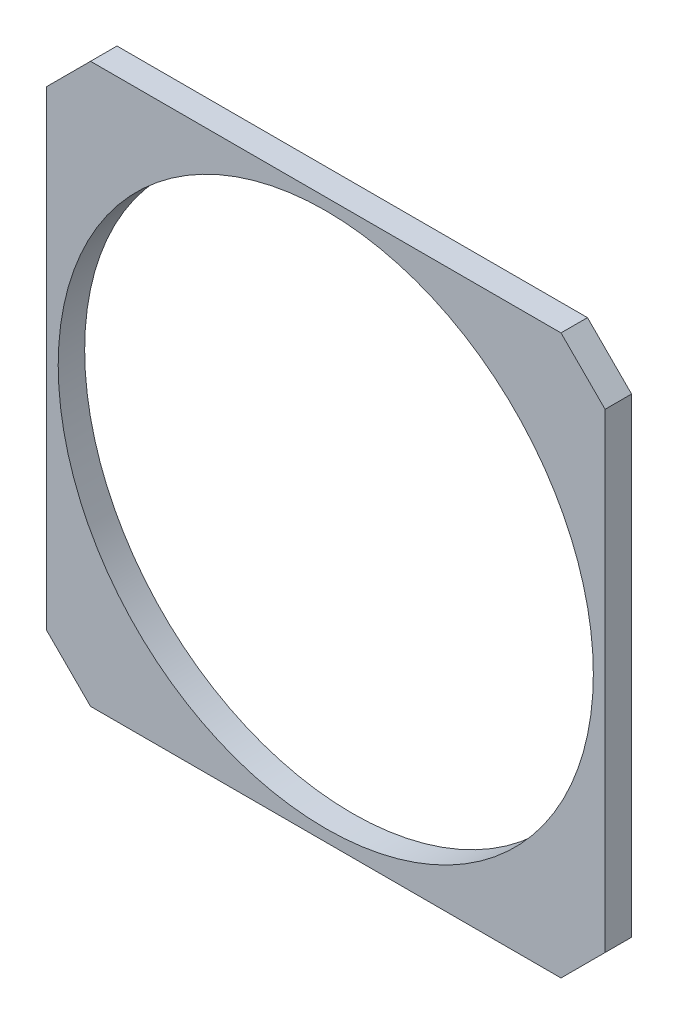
ISO-10303-21;
HEADER;
FILE_DESCRIPTION(('STEP AP214'),'2;1');
FILE_NAME('part.step','',(''),(''),'','','');
FILE_SCHEMA(('AUTOMOTIVE_DESIGN { 1 0 10303 214 1 1 1 1 }'));
ENDSEC;
DATA;
#1=APPLICATION_CONTEXT('core data for automotive mechanical design processes');
#2=APPLICATION_PROTOCOL_DEFINITION('international standard','automotive_design',2000,#1);
#3=PRODUCT_CONTEXT('',#1,'mechanical');
#4=PRODUCT('Part','Part','',(#3));
#5=PRODUCT_RELATED_PRODUCT_CATEGORY('part','',(#4));
#6=PRODUCT_DEFINITION_FORMATION('','',#4);
#7=PRODUCT_DEFINITION_CONTEXT('part definition',#1,'design');
#8=PRODUCT_DEFINITION('design','',#6,#7);
#9=PRODUCT_DEFINITION_SHAPE('','',#8);
#10=(LENGTH_UNIT() NAMED_UNIT(*) SI_UNIT(.MILLI.,.METRE.));
#11=(NAMED_UNIT(*) PLANE_ANGLE_UNIT() SI_UNIT($,.RADIAN.));
#12=(NAMED_UNIT(*) SI_UNIT($,.STERADIAN.) SOLID_ANGLE_UNIT());
#13=UNCERTAINTY_MEASURE_WITH_UNIT(LENGTH_MEASURE(1.E-05),#10,'distance_accuracy_value','');
#14=(GEOMETRIC_REPRESENTATION_CONTEXT(3) GLOBAL_UNCERTAINTY_ASSIGNED_CONTEXT((#13)) GLOBAL_UNIT_ASSIGNED_CONTEXT((#10,
#11,#12)) REPRESENTATION_CONTEXT('',''));
#15=CARTESIAN_POINT('',(0.,0.,0.));
#16=DIRECTION('',(0.,0.,1.));
#17=DIRECTION('',(1.,0.,0.));
#18=AXIS2_PLACEMENT_3D('',#15,#16,#17);
#19=CARTESIAN_POINT('',(0.,0.,4.5));
#20=DIRECTION('',(0.,0.,-1.));
#21=DIRECTION('',(-1.,0.,0.));
#22=AXIS2_PLACEMENT_3D('',#19,#20,#21);
#23=PLANE('',#22);
#24=DIRECTION('',(-0.707106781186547,-0.707106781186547,0.));
#25=VECTOR('',#24,1.);
#26=CARTESIAN_POINT('',(-47.5,40.,4.5));
#27=LINE('',#26,#25);
#28=CARTESIAN_POINT('',(-40.,47.5,4.5));
#29=VERTEX_POINT('',#28);
#30=CARTESIAN_POINT('',(-47.5,40.,4.5));
#31=VERTEX_POINT('',#30);
#32=EDGE_CURVE('E147',#29,#31,#27,.T.);
#33=ORIENTED_EDGE('',*,*,#32,.T.);
#34=DIRECTION('',(0.,-1.,0.));
#35=VECTOR('',#34,1.);
#36=CARTESIAN_POINT('',(-47.5,-40.,4.5));
#37=LINE('',#36,#35);
#38=CARTESIAN_POINT('',(-47.5,-40.,4.5));
#39=VERTEX_POINT('',#38);
#40=EDGE_CURVE('E95',#31,#39,#37,.T.);
#41=ORIENTED_EDGE('',*,*,#40,.T.);
#42=DIRECTION('',(0.707106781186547,-0.707106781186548,0.));
#43=VECTOR('',#42,1.);
#44=CARTESIAN_POINT('',(-40.,-47.5,4.5));
#45=LINE('',#44,#43);
#46=CARTESIAN_POINT('',(-40.,-47.5,4.5));
#47=VERTEX_POINT('',#46);
#48=EDGE_CURVE('E162',#39,#47,#45,.T.);
#49=ORIENTED_EDGE('',*,*,#48,.T.);
#50=DIRECTION('',(1.,0.,0.));
#51=VECTOR('',#50,1.);
#52=CARTESIAN_POINT('',(40.,-47.5,4.5));
#53=LINE('',#52,#51);
#54=CARTESIAN_POINT('',(40.,-47.5,4.5));
#55=VERTEX_POINT('',#54);
#56=EDGE_CURVE('E175',#47,#55,#53,.T.);
#57=ORIENTED_EDGE('',*,*,#56,.T.);
#58=DIRECTION('',(0.707106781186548,0.707106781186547,0.));
#59=VECTOR('',#58,1.);
#60=CARTESIAN_POINT('',(47.5,-40.,4.5));
#61=LINE('',#60,#59);
#62=CARTESIAN_POINT('',(47.5,-40.,4.5));
#63=VERTEX_POINT('',#62);
#64=EDGE_CURVE('E114',#55,#63,#61,.T.);
#65=ORIENTED_EDGE('',*,*,#64,.T.);
#66=DIRECTION('',(0.,1.,0.));
#67=VECTOR('',#66,1.);
#68=CARTESIAN_POINT('',(47.5,40.,4.5));
#69=LINE('',#68,#67);
#70=CARTESIAN_POINT('',(47.5,40.,4.5));
#71=VERTEX_POINT('',#70);
#72=EDGE_CURVE('E108',#63,#71,#69,.T.);
#73=ORIENTED_EDGE('',*,*,#72,.T.);
#74=DIRECTION('',(-0.707106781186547,0.707106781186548,0.));
#75=VECTOR('',#74,1.);
#76=CARTESIAN_POINT('',(40.,47.5,4.5));
#77=LINE('',#76,#75);
#78=CARTESIAN_POINT('',(40.,47.5,4.5));
#79=VERTEX_POINT('',#78);
#80=EDGE_CURVE('E112',#71,#79,#77,.T.);
#81=ORIENTED_EDGE('',*,*,#80,.T.);
#82=DIRECTION('',(-1.,0.,0.));
#83=VECTOR('',#82,1.);
#84=CARTESIAN_POINT('',(-40.,47.5,4.5));
#85=LINE('',#84,#83);
#86=EDGE_CURVE('E52',#79,#29,#85,.T.);
#87=ORIENTED_EDGE('',*,*,#86,.T.);
#88=EDGE_LOOP('',(#33,#41,#49,#57,#65,#73,#81,#87));
#89=FACE_BOUND('',#88,.T.);
#90=CARTESIAN_POINT('',(0.,0.,4.5));
#91=DIRECTION('',(0.,0.,1.));
#92=DIRECTION('',(1.,0.,0.));
#93=AXIS2_PLACEMENT_3D('',#90,#91,#92);
#94=CIRCLE('',#93,45.5);
#95=CARTESIAN_POINT('',(45.5,0.,4.5));
#96=VERTEX_POINT('',#95);
#97=EDGE_CURVE('E136',#96,#96,#94,.T.);
#98=ORIENTED_EDGE('',*,*,#97,.F.);
#99=EDGE_LOOP('',(#98));
#100=FACE_BOUND('',#99,.T.);
#101=ADVANCED_FACE('F35',(#89,#100),#23,.F.);
#102=CARTESIAN_POINT('',(0.,0.,0.));
#103=DIRECTION('',(0.,0.,-1.));
#104=DIRECTION('',(-1.,0.,0.));
#105=AXIS2_PLACEMENT_3D('',#102,#103,#104);
#106=PLANE('',#105);
#107=DIRECTION('',(-0.707106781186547,-0.707106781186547,0.));
#108=VECTOR('',#107,1.);
#109=CARTESIAN_POINT('',(-47.5,40.,0.));
#110=LINE('',#109,#108);
#111=CARTESIAN_POINT('',(-40.,47.5,0.));
#112=VERTEX_POINT('',#111);
#113=CARTESIAN_POINT('',(-47.5,40.,0.));
#114=VERTEX_POINT('',#113);
#115=EDGE_CURVE('E132',#112,#114,#110,.T.);
#116=ORIENTED_EDGE('',*,*,#115,.F.);
#117=DIRECTION('',(-1.,0.,0.));
#118=VECTOR('',#117,1.);
#119=CARTESIAN_POINT('',(-40.,47.5,0.));
#120=LINE('',#119,#118);
#121=CARTESIAN_POINT('',(40.,47.5,0.));
#122=VERTEX_POINT('',#121);
#123=EDGE_CURVE('E87',#122,#112,#120,.T.);
#124=ORIENTED_EDGE('',*,*,#123,.F.);
#125=DIRECTION('',(-0.707106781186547,0.707106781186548,0.));
#126=VECTOR('',#125,1.);
#127=CARTESIAN_POINT('',(40.,47.5,0.));
#128=LINE('',#127,#126);
#129=CARTESIAN_POINT('',(47.5,40.,0.));
#130=VERTEX_POINT('',#129);
#131=EDGE_CURVE('E81',#130,#122,#128,.T.);
#132=ORIENTED_EDGE('',*,*,#131,.F.);
#133=DIRECTION('',(0.,1.,0.));
#134=VECTOR('',#133,1.);
#135=CARTESIAN_POINT('',(47.5,40.,0.));
#136=LINE('',#135,#134);
#137=CARTESIAN_POINT('',(47.5,-40.,0.));
#138=VERTEX_POINT('',#137);
#139=EDGE_CURVE('E122',#138,#130,#136,.T.);
#140=ORIENTED_EDGE('',*,*,#139,.F.);
#141=DIRECTION('',(0.707106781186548,0.707106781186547,0.));
#142=VECTOR('',#141,1.);
#143=CARTESIAN_POINT('',(47.5,-40.,0.));
#144=LINE('',#143,#142);
#145=CARTESIAN_POINT('',(40.,-47.5,0.));
#146=VERTEX_POINT('',#145);
#147=EDGE_CURVE('E142',#146,#138,#144,.T.);
#148=ORIENTED_EDGE('',*,*,#147,.F.);
#149=DIRECTION('',(1.,0.,0.));
#150=VECTOR('',#149,1.);
#151=CARTESIAN_POINT('',(40.,-47.5,0.));
#152=LINE('',#151,#150);
#153=CARTESIAN_POINT('',(-40.,-47.5,0.));
#154=VERTEX_POINT('',#153);
#155=EDGE_CURVE('E140',#154,#146,#152,.T.);
#156=ORIENTED_EDGE('',*,*,#155,.F.);
#157=DIRECTION('',(0.707106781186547,-0.707106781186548,0.));
#158=VECTOR('',#157,1.);
#159=CARTESIAN_POINT('',(-40.,-47.5,0.));
#160=LINE('',#159,#158);
#161=CARTESIAN_POINT('',(-47.5,-40.,0.));
#162=VERTEX_POINT('',#161);
#163=EDGE_CURVE('E138',#162,#154,#160,.T.);
#164=ORIENTED_EDGE('',*,*,#163,.F.);
#165=DIRECTION('',(0.,-1.,0.));
#166=VECTOR('',#165,1.);
#167=CARTESIAN_POINT('',(-47.5,-40.,0.));
#168=LINE('',#167,#166);
#169=EDGE_CURVE('E135',#114,#162,#168,.T.);
#170=ORIENTED_EDGE('',*,*,#169,.F.);
#171=EDGE_LOOP('',(#116,#124,#132,#140,#148,#156,#164,#170));
#172=FACE_BOUND('',#171,.T.);
#173=CARTESIAN_POINT('',(0.,0.,0.));
#174=DIRECTION('',(0.,0.,1.));
#175=DIRECTION('',(1.,0.,0.));
#176=AXIS2_PLACEMENT_3D('',#173,#174,#175);
#177=CIRCLE('',#176,45.5);
#178=CARTESIAN_POINT('',(45.5,0.,0.));
#179=VERTEX_POINT('',#178);
#180=EDGE_CURVE('E181',#179,#179,#177,.T.);
#181=ORIENTED_EDGE('',*,*,#180,.T.);
#182=EDGE_LOOP('',(#181));
#183=FACE_BOUND('',#182,.T.);
#184=ADVANCED_FACE('F166',(#172,#183),#106,.T.);
#185=CARTESIAN_POINT('',(-47.5,40.,4.5));
#186=DIRECTION('',(0.707106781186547,-0.707106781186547,0.));
#187=DIRECTION('',(0.707106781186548,0.707106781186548,0.));
#188=AXIS2_PLACEMENT_3D('',#185,#186,#187);
#189=PLANE('',#188);
#190=ORIENTED_EDGE('',*,*,#115,.T.);
#191=DIRECTION('',(0.,0.,-1.));
#192=VECTOR('',#191,1.);
#193=CARTESIAN_POINT('',(-47.5,40.,4.5));
#194=LINE('',#193,#192);
#195=EDGE_CURVE('E11',#31,#114,#194,.T.);
#196=ORIENTED_EDGE('',*,*,#195,.F.);
#197=ORIENTED_EDGE('',*,*,#32,.F.);
#198=DIRECTION('',(0.,0.,-1.));
#199=VECTOR('',#198,1.);
#200=CARTESIAN_POINT('',(-40.,47.5,4.5));
#201=LINE('',#200,#199);
#202=EDGE_CURVE('E128',#29,#112,#201,.T.);
#203=ORIENTED_EDGE('',*,*,#202,.T.);
#204=EDGE_LOOP('',(#190,#196,#197,#203));
#205=FACE_BOUND('',#204,.T.);
#206=ADVANCED_FACE('F37',(#205),#189,.F.);
#207=CARTESIAN_POINT('',(-47.5,-40.,4.5));
#208=DIRECTION('',(1.,0.,0.));
#209=DIRECTION('',(0.,0.,-1.));
#210=AXIS2_PLACEMENT_3D('',#207,#208,#209);
#211=PLANE('',#210);
#212=ORIENTED_EDGE('',*,*,#169,.T.);
#213=DIRECTION('',(0.,0.,-1.));
#214=VECTOR('',#213,1.);
#215=CARTESIAN_POINT('',(-47.5,-40.,4.5));
#216=LINE('',#215,#214);
#217=EDGE_CURVE('E44',#39,#162,#216,.T.);
#218=ORIENTED_EDGE('',*,*,#217,.F.);
#219=ORIENTED_EDGE('',*,*,#40,.F.);
#220=ORIENTED_EDGE('',*,*,#195,.T.);
#221=EDGE_LOOP('',(#212,#218,#219,#220));
#222=FACE_BOUND('',#221,.T.);
#223=ADVANCED_FACE('F209',(#222),#211,.F.);
#224=CARTESIAN_POINT('',(-40.,-47.5,4.5));
#225=DIRECTION('',(0.707106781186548,0.707106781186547,0.));
#226=DIRECTION('',(-0.707106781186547,0.707106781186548,0.));
#227=AXIS2_PLACEMENT_3D('',#224,#225,#226);
#228=PLANE('',#227);
#229=ORIENTED_EDGE('',*,*,#163,.T.);
#230=DIRECTION('',(0.,0.,-1.));
#231=VECTOR('',#230,1.);
#232=CARTESIAN_POINT('',(-40.,-47.5,4.5));
#233=LINE('',#232,#231);
#234=EDGE_CURVE('E154',#47,#154,#233,.T.);
#235=ORIENTED_EDGE('',*,*,#234,.F.);
#236=ORIENTED_EDGE('',*,*,#48,.F.);
#237=ORIENTED_EDGE('',*,*,#217,.T.);
#238=EDGE_LOOP('',(#229,#235,#236,#237));
#239=FACE_BOUND('',#238,.T.);
#240=ADVANCED_FACE('F160',(#239),#228,.F.);
#241=CARTESIAN_POINT('',(40.,-47.5,4.5));
#242=DIRECTION('',(0.,1.,0.));
#243=DIRECTION('',(-1.,0.,0.));
#244=AXIS2_PLACEMENT_3D('',#241,#242,#243);
#245=PLANE('',#244);
#246=ORIENTED_EDGE('',*,*,#155,.T.);
#247=DIRECTION('',(0.,0.,-1.));
#248=VECTOR('',#247,1.);
#249=CARTESIAN_POINT('',(40.,-47.5,4.5));
#250=LINE('',#249,#248);
#251=EDGE_CURVE('E151',#55,#146,#250,.T.);
#252=ORIENTED_EDGE('',*,*,#251,.F.);
#253=ORIENTED_EDGE('',*,*,#56,.F.);
#254=ORIENTED_EDGE('',*,*,#234,.T.);
#255=EDGE_LOOP('',(#246,#252,#253,#254));
#256=FACE_BOUND('',#255,.T.);
#257=ADVANCED_FACE('F171',(#256),#245,.F.);
#258=CARTESIAN_POINT('',(47.5,-40.,4.5));
#259=DIRECTION('',(-0.707106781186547,0.707106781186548,0.));
#260=DIRECTION('',(-0.707106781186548,-0.707106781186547,0.));
#261=AXIS2_PLACEMENT_3D('',#258,#259,#260);
#262=PLANE('',#261);
#263=ORIENTED_EDGE('',*,*,#147,.T.);
#264=DIRECTION('',(0.,0.,-1.));
#265=VECTOR('',#264,1.);
#266=CARTESIAN_POINT('',(47.5,-40.,4.5));
#267=LINE('',#266,#265);
#268=EDGE_CURVE('E123',#63,#138,#267,.T.);
#269=ORIENTED_EDGE('',*,*,#268,.F.);
#270=ORIENTED_EDGE('',*,*,#64,.F.);
#271=ORIENTED_EDGE('',*,*,#251,.T.);
#272=EDGE_LOOP('',(#263,#269,#270,#271));
#273=FACE_BOUND('',#272,.T.);
#274=ADVANCED_FACE('F174',(#273),#262,.F.);
#275=CARTESIAN_POINT('',(47.5,40.,4.5));
#276=DIRECTION('',(-1.,0.,0.));
#277=DIRECTION('',(0.,-1.,0.));
#278=AXIS2_PLACEMENT_3D('',#275,#276,#277);
#279=PLANE('',#278);
#280=ORIENTED_EDGE('',*,*,#139,.T.);
#281=DIRECTION('',(0.,0.,-1.));
#282=VECTOR('',#281,1.);
#283=CARTESIAN_POINT('',(47.5,40.,4.5));
#284=LINE('',#283,#282);
#285=EDGE_CURVE('E119',#71,#130,#284,.T.);
#286=ORIENTED_EDGE('',*,*,#285,.F.);
#287=ORIENTED_EDGE('',*,*,#72,.F.);
#288=ORIENTED_EDGE('',*,*,#268,.T.);
#289=EDGE_LOOP('',(#280,#286,#287,#288));
#290=FACE_BOUND('',#289,.T.);
#291=ADVANCED_FACE('F120',(#290),#279,.F.);
#292=CARTESIAN_POINT('',(40.,47.5,4.5));
#293=DIRECTION('',(-0.707106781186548,-0.707106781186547,0.));
#294=DIRECTION('',(0.707106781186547,-0.707106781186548,0.));
#295=AXIS2_PLACEMENT_3D('',#292,#293,#294);
#296=PLANE('',#295);
#297=ORIENTED_EDGE('',*,*,#131,.T.);
#298=DIRECTION('',(0.,0.,-1.));
#299=VECTOR('',#298,1.);
#300=CARTESIAN_POINT('',(40.,47.5,4.5));
#301=LINE('',#300,#299);
#302=EDGE_CURVE('E124',#79,#122,#301,.T.);
#303=ORIENTED_EDGE('',*,*,#302,.F.);
#304=ORIENTED_EDGE('',*,*,#80,.F.);
#305=ORIENTED_EDGE('',*,*,#285,.T.);
#306=EDGE_LOOP('',(#297,#303,#304,#305));
#307=FACE_BOUND('',#306,.T.);
#308=ADVANCED_FACE('F126',(#307),#296,.F.);
#309=CARTESIAN_POINT('',(-40.,47.5,4.5));
#310=DIRECTION('',(0.,-1.,0.));
#311=DIRECTION('',(0.,0.,-1.));
#312=AXIS2_PLACEMENT_3D('',#309,#310,#311);
#313=PLANE('',#312);
#314=ORIENTED_EDGE('',*,*,#123,.T.);
#315=ORIENTED_EDGE('',*,*,#202,.F.);
#316=ORIENTED_EDGE('',*,*,#86,.F.);
#317=ORIENTED_EDGE('',*,*,#302,.T.);
#318=EDGE_LOOP('',(#314,#315,#316,#317));
#319=FACE_BOUND('',#318,.T.);
#320=ADVANCED_FACE('F197',(#319),#313,.F.);
#321=CARTESIAN_POINT('',(0.,0.,4.5));
#322=DIRECTION('',(0.,0.,-1.));
#323=DIRECTION('',(-1.,0.,0.));
#324=AXIS2_PLACEMENT_3D('',#321,#322,#323);
#325=CYLINDRICAL_SURFACE('',#324,45.5);
#326=ORIENTED_EDGE('',*,*,#97,.T.);
#327=EDGE_LOOP('',(#326));
#328=FACE_BOUND('',#327,.T.);
#329=ORIENTED_EDGE('',*,*,#180,.F.);
#330=EDGE_LOOP('',(#329));
#331=FACE_BOUND('',#330,.T.);
#332=ADVANCED_FACE('F187',(#328,#331),#325,.F.);
#333=CLOSED_SHELL('',(#101,#184,#206,#223,#240,#257,#274,#291,#308,#320,#332));
#334=MANIFOLD_SOLID_BREP('B2',#333);
#335=ADVANCED_BREP_SHAPE_REPRESENTATION('',(#18,#334),#14);
#336=SHAPE_DEFINITION_REPRESENTATION(#9,#335);
ENDSEC;
END-ISO-10303-21;
